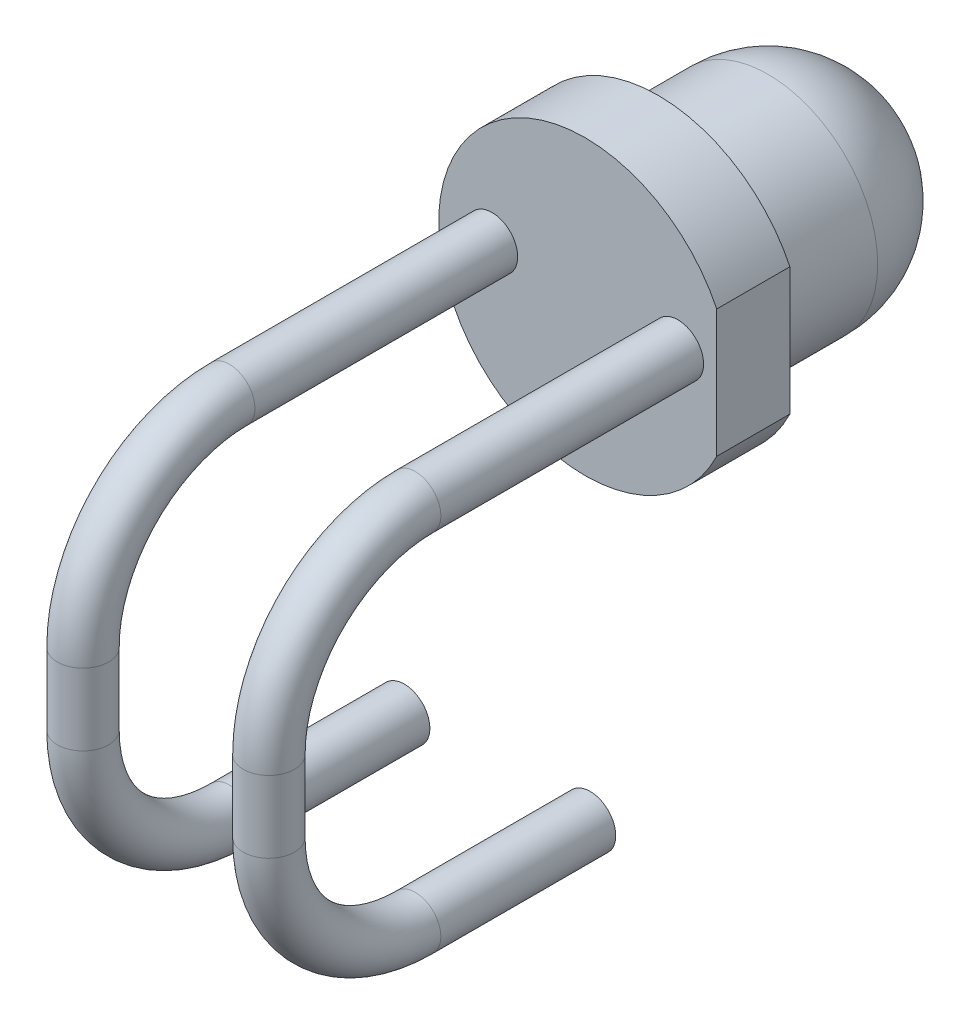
from build123d import *

# Parameters (mm, degrees)
ESQUISSE1_R                = 1.5
BASE_EXTRUSION_DEPTH       = 4
BOSS_EXTRU_1_DEPTH         = 1
CONG_1_R                   = 1.5
ESQUISSE10_R               = 0.35
R_P_TITION_LIN_AIRE1_COUNT = 2
R_P_TITION_LIN_AIRE1_PITCH = 2.54


with BuildPart() as part:
    # Esquisse1 → Base-Extrusion (new body)
    with BuildSketch(Plane.XY):
        Circle(ESQUISSE1_R)
    extrude(amount=BASE_EXTRUSION_DEPTH)

    # Esquisse2 → Boss.-Extru.1 (add)
    with BuildSketch(Plane.XY.offset(4)):
        with BuildLine():
            Line((1.8, 0.871779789), (1.8, -0.871779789))
            ThreePointArc((1.8, -0.871779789), (-2, 0), (1.8, 0.871779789))
        make_face()
    extrude(amount=-BOSS_EXTRU_1_DEPTH)

    # Cong_1
    cong_1_edges = [part.edges().sort_by_distance(p)[0] for p in [
        (-1.5, 0, 0),
    ]]
    fillet(cong_1_edges, radius=CONG_1_R)

    # Balayage1: sweep along a path in Esquisse9
    with BuildLine(Plane(origin=(1.27, 0, 0), x_dir=(0, 0, -1), z_dir=(1, 0, 0))) as balayage1_path:
        Line((-4, 0.128695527), (-7.59, 0.128695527))
        ThreePointArc((-7.59, 0.128695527), (-9.004213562, -0.457090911), (-9.59, -1.871304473))
        Line((-9.59, -1.871304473), (-9.59, -2.851304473))
        ThreePointArc((-9.59, -2.851304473), (-9.004213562, -4.265518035), (-7.59, -4.851304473))
        Line((-7.59, -4.851304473), (-5.2, -4.851304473))
    # Esquisse10 → Balayage1 (sweep)
    with BuildSketch(Plane.XY.offset(4)):
        with Locations((1.27, 0.128695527)):
            Circle(ESQUISSE10_R)
    balayage1 = sweep(path=balayage1_path.line)

    # R_p_tition lin_aire1: Balayage1 ×2
    with Locations(*[(-i * R_P_TITION_LIN_AIRE1_PITCH, 0, 0) for i in range(1, R_P_TITION_LIN_AIRE1_COUNT)]):
        add(balayage1)


solid = part.part
